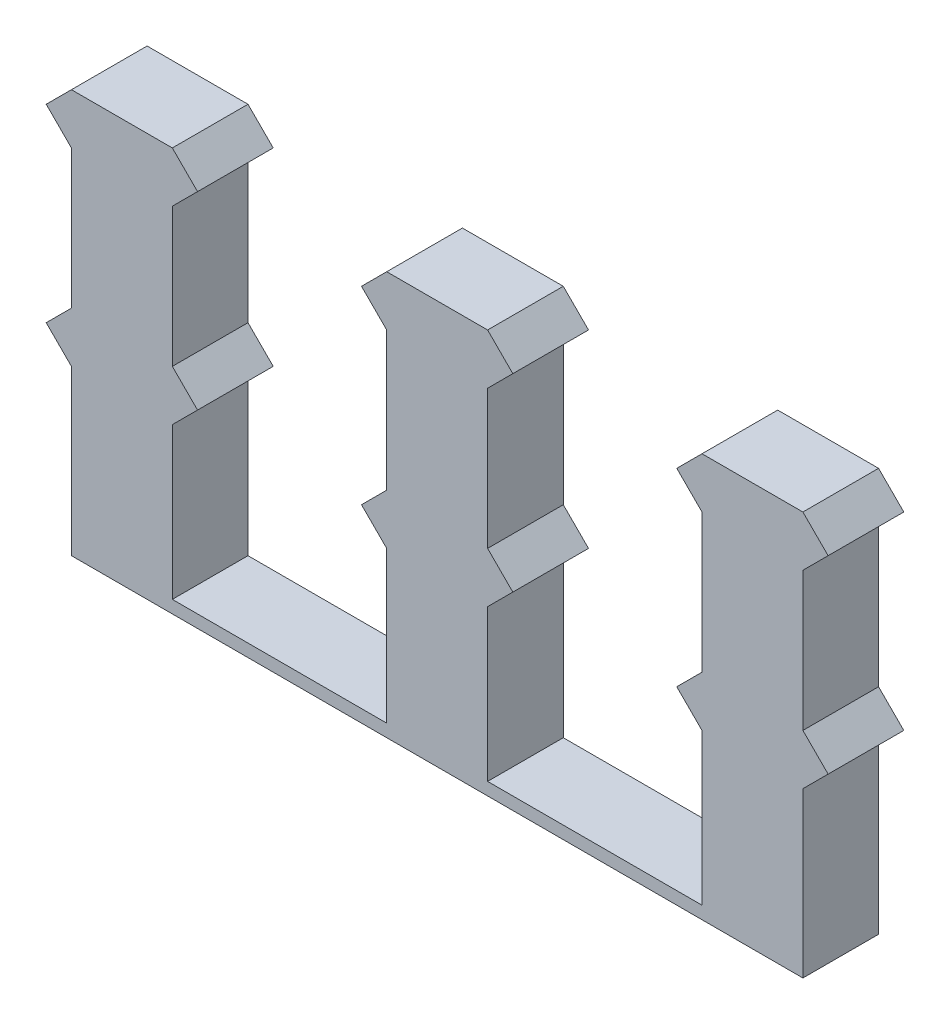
ISO-10303-21;
HEADER;
FILE_DESCRIPTION(('STEP AP214'),'2;1');
FILE_NAME('part.step','',(''),(''),'','','');
FILE_SCHEMA(('AUTOMOTIVE_DESIGN { 1 0 10303 214 1 1 1 1 }'));
ENDSEC;
DATA;
#1=APPLICATION_CONTEXT('core data for automotive mechanical design processes');
#2=APPLICATION_PROTOCOL_DEFINITION('international standard','automotive_design',2000,#1);
#3=PRODUCT_CONTEXT('',#1,'mechanical');
#4=PRODUCT('Part','Part','',(#3));
#5=PRODUCT_RELATED_PRODUCT_CATEGORY('part','',(#4));
#6=PRODUCT_DEFINITION_FORMATION('','',#4);
#7=PRODUCT_DEFINITION_CONTEXT('part definition',#1,'design');
#8=PRODUCT_DEFINITION('design','',#6,#7);
#9=PRODUCT_DEFINITION_SHAPE('','',#8);
#10=(LENGTH_UNIT() NAMED_UNIT(*) SI_UNIT(.MILLI.,.METRE.));
#11=(NAMED_UNIT(*) PLANE_ANGLE_UNIT() SI_UNIT($,.RADIAN.));
#12=(NAMED_UNIT(*) SI_UNIT($,.STERADIAN.) SOLID_ANGLE_UNIT());
#13=UNCERTAINTY_MEASURE_WITH_UNIT(LENGTH_MEASURE(1.E-05),#10,'distance_accuracy_value','');
#14=(GEOMETRIC_REPRESENTATION_CONTEXT(3) GLOBAL_UNCERTAINTY_ASSIGNED_CONTEXT((#13)) GLOBAL_UNIT_ASSIGNED_CONTEXT((#10,
#11,#12)) REPRESENTATION_CONTEXT('',''));
#15=CARTESIAN_POINT('',(0.,0.,0.));
#16=DIRECTION('',(0.,0.,1.));
#17=DIRECTION('',(1.,0.,0.));
#18=AXIS2_PLACEMENT_3D('',#15,#16,#17);
#19=CARTESIAN_POINT('',(0.,0.,0.));
#20=DIRECTION('',(0.,0.,1.));
#21=DIRECTION('',(1.,0.,0.));
#22=AXIS2_PLACEMENT_3D('',#19,#20,#21);
#23=PLANE('',#22);
#24=DIRECTION('',(0.707106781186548,0.707106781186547,0.));
#25=VECTOR('',#24,1.);
#26=CARTESIAN_POINT('',(3.3,1.3,0.));
#27=LINE('',#26,#25);
#28=CARTESIAN_POINT('',(3.3,1.3,0.));
#29=VERTEX_POINT('',#28);
#30=CARTESIAN_POINT('',(3.5,1.5,0.));
#31=VERTEX_POINT('',#30);
#32=EDGE_CURVE('E331',#29,#31,#27,.T.);
#33=ORIENTED_EDGE('',*,*,#32,.F.);
#34=DIRECTION('',(0.,1.,0.));
#35=VECTOR('',#34,1.);
#36=CARTESIAN_POINT('',(3.3,0.,0.));
#37=LINE('',#36,#35);
#38=CARTESIAN_POINT('',(3.3,0.1,0.));
#39=VERTEX_POINT('',#38);
#40=EDGE_CURVE('E329',#39,#29,#37,.T.);
#41=ORIENTED_EDGE('',*,*,#40,.F.);
#42=DIRECTION('',(1.,0.,0.));
#43=VECTOR('',#42,1.);
#44=CARTESIAN_POINT('',(0.,0.1,0.));
#45=LINE('',#44,#43);
#46=CARTESIAN_POINT('',(5.,0.1,0.));
#47=VERTEX_POINT('',#46);
#48=EDGE_CURVE('E327',#47,#39,#45,.F.);
#49=ORIENTED_EDGE('',*,*,#48,.F.);
#50=DIRECTION('',(0.,1.,0.));
#51=VECTOR('',#50,1.);
#52=CARTESIAN_POINT('',(5.,0.,0.));
#53=LINE('',#52,#51);
#54=CARTESIAN_POINT('',(5.,1.3,0.));
#55=VERTEX_POINT('',#54);
#56=EDGE_CURVE('E325',#55,#47,#53,.F.);
#57=ORIENTED_EDGE('',*,*,#56,.F.);
#58=DIRECTION('',(0.707106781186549,-0.707106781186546,0.));
#59=VECTOR('',#58,1.);
#60=CARTESIAN_POINT('',(4.8,1.5,0.));
#61=LINE('',#60,#59);
#62=CARTESIAN_POINT('',(4.8,1.5,0.));
#63=VERTEX_POINT('',#62);
#64=EDGE_CURVE('E323',#63,#55,#61,.T.);
#65=ORIENTED_EDGE('',*,*,#64,.F.);
#66=DIRECTION('',(-0.707106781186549,-0.707106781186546,0.));
#67=VECTOR('',#66,1.);
#68=CARTESIAN_POINT('',(5.,1.7,0.));
#69=LINE('',#68,#67);
#70=CARTESIAN_POINT('',(5.,1.7,0.));
#71=VERTEX_POINT('',#70);
#72=EDGE_CURVE('E321',#71,#63,#69,.T.);
#73=ORIENTED_EDGE('',*,*,#72,.F.);
#74=DIRECTION('',(0.,1.,0.));
#75=VECTOR('',#74,1.);
#76=CARTESIAN_POINT('',(5.,0.,0.));
#77=LINE('',#76,#75);
#78=CARTESIAN_POINT('',(5.,2.8,0.));
#79=VERTEX_POINT('',#78);
#80=EDGE_CURVE('E319',#79,#71,#77,.F.);
#81=ORIENTED_EDGE('',*,*,#80,.F.);
#82=DIRECTION('',(0.707106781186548,-0.707106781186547,0.));
#83=VECTOR('',#82,1.);
#84=CARTESIAN_POINT('',(4.8,3.,0.));
#85=LINE('',#84,#83);
#86=CARTESIAN_POINT('',(4.8,3.,0.));
#87=VERTEX_POINT('',#86);
#88=EDGE_CURVE('E317',#87,#79,#85,.T.);
#89=ORIENTED_EDGE('',*,*,#88,.F.);
#90=DIRECTION('',(-0.707106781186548,-0.707106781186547,0.));
#91=VECTOR('',#90,1.);
#92=CARTESIAN_POINT('',(5.,3.2,0.));
#93=LINE('',#92,#91);
#94=CARTESIAN_POINT('',(5.,3.2,0.));
#95=VERTEX_POINT('',#94);
#96=EDGE_CURVE('E315',#95,#87,#93,.T.);
#97=ORIENTED_EDGE('',*,*,#96,.F.);
#98=DIRECTION('',(1.,0.,0.));
#99=VECTOR('',#98,1.);
#100=CARTESIAN_POINT('',(0.,3.2,0.));
#101=LINE('',#100,#99);
#102=CARTESIAN_POINT('',(5.8,3.2,0.));
#103=VERTEX_POINT('',#102);
#104=EDGE_CURVE('E313',#103,#95,#101,.F.);
#105=ORIENTED_EDGE('',*,*,#104,.F.);
#106=DIRECTION('',(-0.707106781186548,0.707106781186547,0.));
#107=VECTOR('',#106,1.);
#108=CARTESIAN_POINT('',(6.,3.,0.));
#109=LINE('',#108,#107);
#110=CARTESIAN_POINT('',(6.,3.,0.));
#111=VERTEX_POINT('',#110);
#112=EDGE_CURVE('E311',#111,#103,#109,.T.);
#113=ORIENTED_EDGE('',*,*,#112,.F.);
#114=DIRECTION('',(0.707106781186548,0.707106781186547,0.));
#115=VECTOR('',#114,1.);
#116=CARTESIAN_POINT('',(5.8,2.8,0.));
#117=LINE('',#116,#115);
#118=CARTESIAN_POINT('',(5.8,2.8,0.));
#119=VERTEX_POINT('',#118);
#120=EDGE_CURVE('E309',#119,#111,#117,.T.);
#121=ORIENTED_EDGE('',*,*,#120,.F.);
#122=DIRECTION('',(0.,1.,0.));
#123=VECTOR('',#122,1.);
#124=CARTESIAN_POINT('',(5.8,0.,0.));
#125=LINE('',#124,#123);
#126=CARTESIAN_POINT('',(5.8,1.7,0.));
#127=VERTEX_POINT('',#126);
#128=EDGE_CURVE('E305',#127,#119,#125,.T.);
#129=ORIENTED_EDGE('',*,*,#128,.F.);
#130=DIRECTION('',(-0.707106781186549,0.707106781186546,0.));
#131=VECTOR('',#130,1.);
#132=CARTESIAN_POINT('',(6.,1.5,0.));
#133=LINE('',#132,#131);
#134=CARTESIAN_POINT('',(6.,1.5,0.));
#135=VERTEX_POINT('',#134);
#136=EDGE_CURVE('E304',#135,#127,#133,.T.);
#137=ORIENTED_EDGE('',*,*,#136,.F.);
#138=DIRECTION('',(0.707106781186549,0.707106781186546,0.));
#139=VECTOR('',#138,1.);
#140=CARTESIAN_POINT('',(5.8,1.3,0.));
#141=LINE('',#140,#139);
#142=CARTESIAN_POINT('',(5.8,1.3,0.));
#143=VERTEX_POINT('',#142);
#144=EDGE_CURVE('E283',#143,#135,#141,.T.);
#145=ORIENTED_EDGE('',*,*,#144,.F.);
#146=DIRECTION('',(0.,1.,0.));
#147=VECTOR('',#146,1.);
#148=CARTESIAN_POINT('',(5.8,0.,0.));
#149=LINE('',#148,#147);
#150=CARTESIAN_POINT('',(5.8,0.,0.));
#151=VERTEX_POINT('',#150);
#152=EDGE_CURVE('E20',#151,#143,#149,.T.);
#153=ORIENTED_EDGE('',*,*,#152,.F.);
#154=DIRECTION('',(1.,0.,0.));
#155=VECTOR('',#154,1.);
#156=CARTESIAN_POINT('',(0.,0.,0.));
#157=LINE('',#156,#155);
#158=CARTESIAN_POINT('',(0.,0.,0.));
#159=VERTEX_POINT('',#158);
#160=EDGE_CURVE('E480',#159,#151,#157,.T.);
#161=ORIENTED_EDGE('',*,*,#160,.F.);
#162=DIRECTION('',(0.,1.,0.));
#163=VECTOR('',#162,1.);
#164=CARTESIAN_POINT('',(0.,1.3,0.));
#165=LINE('',#164,#163);
#166=CARTESIAN_POINT('',(0.,1.3,0.));
#167=VERTEX_POINT('',#166);
#168=EDGE_CURVE('E474',#167,#159,#165,.F.);
#169=ORIENTED_EDGE('',*,*,#168,.F.);
#170=DIRECTION('',(0.707106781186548,-0.707106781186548,0.));
#171=VECTOR('',#170,1.);
#172=CARTESIAN_POINT('',(-0.2,1.5,0.));
#173=LINE('',#172,#171);
#174=CARTESIAN_POINT('',(-0.2,1.5,0.));
#175=VERTEX_POINT('',#174);
#176=EDGE_CURVE('E468',#175,#167,#173,.T.);
#177=ORIENTED_EDGE('',*,*,#176,.F.);
#178=DIRECTION('',(-0.707106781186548,-0.707106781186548,0.));
#179=VECTOR('',#178,1.);
#180=CARTESIAN_POINT('',(0.,1.7,0.));
#181=LINE('',#180,#179);
#182=CARTESIAN_POINT('',(0.,1.7,0.));
#183=VERTEX_POINT('',#182);
#184=EDGE_CURVE('E462',#183,#175,#181,.T.);
#185=ORIENTED_EDGE('',*,*,#184,.F.);
#186=DIRECTION('',(0.,1.,0.));
#187=VECTOR('',#186,1.);
#188=CARTESIAN_POINT('',(0.,2.8,0.));
#189=LINE('',#188,#187);
#190=CARTESIAN_POINT('',(0.,2.8,0.));
#191=VERTEX_POINT('',#190);
#192=EDGE_CURVE('E456',#191,#183,#189,.F.);
#193=ORIENTED_EDGE('',*,*,#192,.F.);
#194=DIRECTION('',(0.707106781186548,-0.707106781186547,0.));
#195=VECTOR('',#194,1.);
#196=CARTESIAN_POINT('',(-0.2,3.,0.));
#197=LINE('',#196,#195);
#198=CARTESIAN_POINT('',(-0.200000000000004,3.,0.));
#199=VERTEX_POINT('',#198);
#200=EDGE_CURVE('E450',#199,#191,#197,.T.);
#201=ORIENTED_EDGE('',*,*,#200,.F.);
#202=DIRECTION('',(-0.707106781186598,-0.707106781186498,0.));
#203=VECTOR('',#202,1.);
#204=CARTESIAN_POINT('',(0.,3.2,0.));
#205=LINE('',#204,#203);
#206=CARTESIAN_POINT('',(0.,3.2,0.));
#207=VERTEX_POINT('',#206);
#208=EDGE_CURVE('E444',#207,#199,#205,.T.);
#209=ORIENTED_EDGE('',*,*,#208,.F.);
#210=DIRECTION('',(1.,0.,0.));
#211=VECTOR('',#210,1.);
#212=CARTESIAN_POINT('',(0.8,3.2,0.));
#213=LINE('',#212,#211);
#214=CARTESIAN_POINT('',(0.799999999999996,3.2,0.));
#215=VERTEX_POINT('',#214);
#216=EDGE_CURVE('E438',#215,#207,#213,.F.);
#217=ORIENTED_EDGE('',*,*,#216,.F.);
#218=DIRECTION('',(-0.707106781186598,0.707106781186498,0.));
#219=VECTOR('',#218,1.);
#220=CARTESIAN_POINT('',(1.,3.,0.));
#221=LINE('',#220,#219);
#222=CARTESIAN_POINT('',(1.,3.,0.));
#223=VERTEX_POINT('',#222);
#224=EDGE_CURVE('E432',#223,#215,#221,.T.);
#225=ORIENTED_EDGE('',*,*,#224,.F.);
#226=DIRECTION('',(0.707106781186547,0.707106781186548,0.));
#227=VECTOR('',#226,1.);
#228=CARTESIAN_POINT('',(0.8,2.8,0.));
#229=LINE('',#228,#227);
#230=CARTESIAN_POINT('',(0.8,2.8,0.));
#231=VERTEX_POINT('',#230);
#232=EDGE_CURVE('E426',#231,#223,#229,.T.);
#233=ORIENTED_EDGE('',*,*,#232,.F.);
#234=DIRECTION('',(0.,1.,0.));
#235=VECTOR('',#234,1.);
#236=CARTESIAN_POINT('',(0.8,1.7,0.));
#237=LINE('',#236,#235);
#238=CARTESIAN_POINT('',(0.8,1.7,0.));
#239=VERTEX_POINT('',#238);
#240=EDGE_CURVE('E420',#239,#231,#237,.T.);
#241=ORIENTED_EDGE('',*,*,#240,.F.);
#242=DIRECTION('',(-0.707106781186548,0.707106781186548,0.));
#243=VECTOR('',#242,1.);
#244=CARTESIAN_POINT('',(1.,1.5,0.));
#245=LINE('',#244,#243);
#246=CARTESIAN_POINT('',(1.,1.5,0.));
#247=VERTEX_POINT('',#246);
#248=EDGE_CURVE('E414',#247,#239,#245,.T.);
#249=ORIENTED_EDGE('',*,*,#248,.F.);
#250=DIRECTION('',(0.707106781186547,0.707106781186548,0.));
#251=VECTOR('',#250,1.);
#252=CARTESIAN_POINT('',(0.8,1.3,0.));
#253=LINE('',#252,#251);
#254=CARTESIAN_POINT('',(0.8,1.3,0.));
#255=VERTEX_POINT('',#254);
#256=EDGE_CURVE('E408',#255,#247,#253,.T.);
#257=ORIENTED_EDGE('',*,*,#256,.F.);
#258=DIRECTION('',(0.,1.,0.));
#259=VECTOR('',#258,1.);
#260=CARTESIAN_POINT('',(0.8,0.1,0.));
#261=LINE('',#260,#259);
#262=CARTESIAN_POINT('',(0.8,0.1,0.));
#263=VERTEX_POINT('',#262);
#264=EDGE_CURVE('E402',#263,#255,#261,.T.);
#265=ORIENTED_EDGE('',*,*,#264,.F.);
#266=DIRECTION('',(1.,0.,0.));
#267=VECTOR('',#266,1.);
#268=CARTESIAN_POINT('',(2.5,0.1,0.));
#269=LINE('',#268,#267);
#270=CARTESIAN_POINT('',(2.5,0.1,0.));
#271=VERTEX_POINT('',#270);
#272=EDGE_CURVE('E396',#271,#263,#269,.F.);
#273=ORIENTED_EDGE('',*,*,#272,.F.);
#274=DIRECTION('',(0.,1.,0.));
#275=VECTOR('',#274,1.);
#276=CARTESIAN_POINT('',(2.5,1.3,0.));
#277=LINE('',#276,#275);
#278=CARTESIAN_POINT('',(2.5,1.3,0.));
#279=VERTEX_POINT('',#278);
#280=EDGE_CURVE('E390',#279,#271,#277,.F.);
#281=ORIENTED_EDGE('',*,*,#280,.F.);
#282=DIRECTION('',(0.707106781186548,-0.707106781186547,0.));
#283=VECTOR('',#282,1.);
#284=CARTESIAN_POINT('',(2.3,1.5,0.));
#285=LINE('',#284,#283);
#286=CARTESIAN_POINT('',(2.3,1.5,0.));
#287=VERTEX_POINT('',#286);
#288=EDGE_CURVE('E384',#287,#279,#285,.T.);
#289=ORIENTED_EDGE('',*,*,#288,.F.);
#290=DIRECTION('',(-0.707106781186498,-0.707106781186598,0.));
#291=VECTOR('',#290,1.);
#292=CARTESIAN_POINT('',(2.5,1.7,0.));
#293=LINE('',#292,#291);
#294=CARTESIAN_POINT('',(2.5,1.7,0.));
#295=VERTEX_POINT('',#294);
#296=EDGE_CURVE('E378',#295,#287,#293,.T.);
#297=ORIENTED_EDGE('',*,*,#296,.F.);
#298=DIRECTION('',(0.,1.,0.));
#299=VECTOR('',#298,1.);
#300=CARTESIAN_POINT('',(2.5,2.8,0.));
#301=LINE('',#300,#299);
#302=CARTESIAN_POINT('',(2.5,2.8,0.));
#303=VERTEX_POINT('',#302);
#304=EDGE_CURVE('E372',#303,#295,#301,.F.);
#305=ORIENTED_EDGE('',*,*,#304,.F.);
#306=DIRECTION('',(0.707106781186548,-0.707106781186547,0.));
#307=VECTOR('',#306,1.);
#308=CARTESIAN_POINT('',(2.3,3.,0.));
#309=LINE('',#308,#307);
#310=CARTESIAN_POINT('',(2.3,3.,0.));
#311=VERTEX_POINT('',#310);
#312=EDGE_CURVE('E366',#311,#303,#309,.T.);
#313=ORIENTED_EDGE('',*,*,#312,.F.);
#314=DIRECTION('',(-0.707106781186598,-0.707106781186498,0.));
#315=VECTOR('',#314,1.);
#316=CARTESIAN_POINT('',(2.5,3.2,0.));
#317=LINE('',#316,#315);
#318=CARTESIAN_POINT('',(2.5,3.2,0.));
#319=VERTEX_POINT('',#318);
#320=EDGE_CURVE('E360',#319,#311,#317,.T.);
#321=ORIENTED_EDGE('',*,*,#320,.F.);
#322=DIRECTION('',(1.,0.,0.));
#323=VECTOR('',#322,1.);
#324=CARTESIAN_POINT('',(3.3,3.2,0.));
#325=LINE('',#324,#323);
#326=CARTESIAN_POINT('',(3.3,3.2,0.));
#327=VERTEX_POINT('',#326);
#328=EDGE_CURVE('E354',#327,#319,#325,.F.);
#329=ORIENTED_EDGE('',*,*,#328,.F.);
#330=DIRECTION('',(-0.707106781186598,0.707106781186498,0.));
#331=VECTOR('',#330,1.);
#332=CARTESIAN_POINT('',(3.5,3.,0.));
#333=LINE('',#332,#331);
#334=CARTESIAN_POINT('',(3.5,3.,0.));
#335=VERTEX_POINT('',#334);
#336=EDGE_CURVE('E348',#335,#327,#333,.T.);
#337=ORIENTED_EDGE('',*,*,#336,.F.);
#338=DIRECTION('',(0.707106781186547,0.707106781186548,0.));
#339=VECTOR('',#338,1.);
#340=CARTESIAN_POINT('',(3.3,2.8,0.));
#341=LINE('',#340,#339);
#342=CARTESIAN_POINT('',(3.3,2.8,0.));
#343=VERTEX_POINT('',#342);
#344=EDGE_CURVE('E342',#343,#335,#341,.T.);
#345=ORIENTED_EDGE('',*,*,#344,.F.);
#346=DIRECTION('',(0.,1.,0.));
#347=VECTOR('',#346,1.);
#348=CARTESIAN_POINT('',(3.3,1.7,0.));
#349=LINE('',#348,#347);
#350=CARTESIAN_POINT('',(3.3,1.7,0.));
#351=VERTEX_POINT('',#350);
#352=EDGE_CURVE('E336',#351,#343,#349,.T.);
#353=ORIENTED_EDGE('',*,*,#352,.F.);
#354=DIRECTION('',(-0.707106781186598,0.707106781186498,0.));
#355=VECTOR('',#354,1.);
#356=CARTESIAN_POINT('',(3.5,1.5,0.));
#357=LINE('',#356,#355);
#358=EDGE_CURVE('E333',#31,#351,#357,.T.);
#359=ORIENTED_EDGE('',*,*,#358,.F.);
#360=EDGE_LOOP('',(#33,#41,#49,#57,#65,#73,#81,#89,#97,#105,#113,#121,#129,#137,#145,#153,#161,
#169,#177,#185,#193,#201,#209,#217,#225,#233,#241,#249,#257,#265,#273,#281,#289,#297,#305,#313,
#321,#329,#337,#345,#353,#359));
#361=FACE_BOUND('',#360,.T.);
#362=ADVANCED_FACE('F17',(#361),#23,.F.);
#363=CARTESIAN_POINT('',(3.5,1.5,0.));
#364=DIRECTION('',(0.707106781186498,0.707106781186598,0.));
#365=DIRECTION('',(-0.707106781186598,0.707106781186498,0.));
#366=AXIS2_PLACEMENT_3D('',#363,#364,#365);
#367=PLANE('',#366);
#368=DIRECTION('',(-0.707106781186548,0.707106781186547,0.));
#369=VECTOR('',#368,1.);
#370=CARTESIAN_POINT('',(3.5,1.5,0.6));
#371=LINE('',#370,#369);
#372=CARTESIAN_POINT('',(3.5,1.5,0.6));
#373=VERTEX_POINT('',#372);
#374=CARTESIAN_POINT('',(3.29999999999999,1.69999999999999,0.6));
#375=VERTEX_POINT('',#374);
#376=EDGE_CURVE('E527',#373,#375,#371,.T.);
#377=ORIENTED_EDGE('',*,*,#376,.F.);
#378=DIRECTION('',(0.,0.,1.));
#379=VECTOR('',#378,1.);
#380=CARTESIAN_POINT('',(3.5,1.5,0.));
#381=LINE('',#380,#379);
#382=EDGE_CURVE('E523',#31,#373,#381,.T.);
#383=ORIENTED_EDGE('',*,*,#382,.F.);
#384=ORIENTED_EDGE('',*,*,#358,.T.);
#385=DIRECTION('',(0.,0.,-1.));
#386=VECTOR('',#385,1.);
#387=CARTESIAN_POINT('',(3.3,1.7,0.));
#388=LINE('',#387,#386);
#389=EDGE_CURVE('E339',#375,#351,#388,.T.);
#390=ORIENTED_EDGE('',*,*,#389,.F.);
#391=EDGE_LOOP('',(#377,#383,#384,#390));
#392=FACE_BOUND('',#391,.T.);
#393=ADVANCED_FACE('F658',(#392),#367,.T.);
#394=CARTESIAN_POINT('',(3.3,1.7,0.));
#395=DIRECTION('',(1.,0.,0.));
#396=DIRECTION('',(0.,0.,-1.));
#397=AXIS2_PLACEMENT_3D('',#394,#395,#396);
#398=PLANE('',#397);
#399=DIRECTION('',(0.,1.,0.));
#400=VECTOR('',#399,1.);
#401=CARTESIAN_POINT('',(3.3,0.,0.6));
#402=LINE('',#401,#400);
#403=CARTESIAN_POINT('',(3.3,2.8,0.6));
#404=VERTEX_POINT('',#403);
#405=EDGE_CURVE('E530',#375,#404,#402,.T.);
#406=ORIENTED_EDGE('',*,*,#405,.F.);
#407=ORIENTED_EDGE('',*,*,#389,.T.);
#408=ORIENTED_EDGE('',*,*,#352,.T.);
#409=DIRECTION('',(0.,0.,1.));
#410=VECTOR('',#409,1.);
#411=CARTESIAN_POINT('',(3.3,2.8,0.));
#412=LINE('',#411,#410);
#413=EDGE_CURVE('E345',#404,#343,#412,.F.);
#414=ORIENTED_EDGE('',*,*,#413,.F.);
#415=EDGE_LOOP('',(#406,#407,#408,#414));
#416=FACE_BOUND('',#415,.T.);
#417=ADVANCED_FACE('F662',(#416),#398,.T.);
#418=CARTESIAN_POINT('',(3.3,2.8,0.));
#419=DIRECTION('',(0.707106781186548,-0.707106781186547,0.));
#420=DIRECTION('',(0.707106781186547,0.707106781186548,0.));
#421=AXIS2_PLACEMENT_3D('',#418,#419,#420);
#422=PLANE('',#421);
#423=DIRECTION('',(0.707106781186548,0.707106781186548,0.));
#424=VECTOR('',#423,1.);
#425=CARTESIAN_POINT('',(3.3,2.8,0.6));
#426=LINE('',#425,#424);
#427=CARTESIAN_POINT('',(3.5,3.,0.6));
#428=VERTEX_POINT('',#427);
#429=EDGE_CURVE('E533',#404,#428,#426,.T.);
#430=ORIENTED_EDGE('',*,*,#429,.F.);
#431=ORIENTED_EDGE('',*,*,#413,.T.);
#432=ORIENTED_EDGE('',*,*,#344,.T.);
#433=DIRECTION('',(0.,0.,1.));
#434=VECTOR('',#433,1.);
#435=CARTESIAN_POINT('',(3.5,3.,0.));
#436=LINE('',#435,#434);
#437=EDGE_CURVE('E351',#428,#335,#436,.F.);
#438=ORIENTED_EDGE('',*,*,#437,.F.);
#439=EDGE_LOOP('',(#430,#431,#432,#438));
#440=FACE_BOUND('',#439,.T.);
#441=ADVANCED_FACE('F664',(#440),#422,.T.);
#442=CARTESIAN_POINT('',(3.5,3.,0.));
#443=DIRECTION('',(0.707106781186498,0.707106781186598,0.));
#444=DIRECTION('',(-0.707106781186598,0.707106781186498,0.));
#445=AXIS2_PLACEMENT_3D('',#442,#443,#444);
#446=PLANE('',#445);
#447=DIRECTION('',(-0.707106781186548,0.707106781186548,0.));
#448=VECTOR('',#447,1.);
#449=CARTESIAN_POINT('',(3.5,3.,0.6));
#450=LINE('',#449,#448);
#451=CARTESIAN_POINT('',(3.29999999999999,3.19999999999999,0.6));
#452=VERTEX_POINT('',#451);
#453=EDGE_CURVE('E536',#428,#452,#450,.T.);
#454=ORIENTED_EDGE('',*,*,#453,.F.);
#455=ORIENTED_EDGE('',*,*,#437,.T.);
#456=ORIENTED_EDGE('',*,*,#336,.T.);
#457=DIRECTION('',(0.,0.,1.));
#458=VECTOR('',#457,1.);
#459=CARTESIAN_POINT('',(3.3,3.2,0.));
#460=LINE('',#459,#458);
#461=EDGE_CURVE('E357',#452,#327,#460,.F.);
#462=ORIENTED_EDGE('',*,*,#461,.F.);
#463=EDGE_LOOP('',(#454,#455,#456,#462));
#464=FACE_BOUND('',#463,.T.);
#465=ADVANCED_FACE('F667',(#464),#446,.T.);
#466=CARTESIAN_POINT('',(3.3,3.2,0.));
#467=DIRECTION('',(0.,1.,0.));
#468=DIRECTION('',(0.,0.,1.));
#469=AXIS2_PLACEMENT_3D('',#466,#467,#468);
#470=PLANE('',#469);
#471=DIRECTION('',(1.,0.,0.));
#472=VECTOR('',#471,1.);
#473=CARTESIAN_POINT('',(0.,3.2,0.6));
#474=LINE('',#473,#472);
#475=CARTESIAN_POINT('',(2.5,3.2,0.6));
#476=VERTEX_POINT('',#475);
#477=EDGE_CURVE('E539',#452,#476,#474,.F.);
#478=ORIENTED_EDGE('',*,*,#477,.F.);
#479=ORIENTED_EDGE('',*,*,#461,.T.);
#480=ORIENTED_EDGE('',*,*,#328,.T.);
#481=DIRECTION('',(0.,0.,1.));
#482=VECTOR('',#481,1.);
#483=CARTESIAN_POINT('',(2.5,3.2,0.));
#484=LINE('',#483,#482);
#485=EDGE_CURVE('E363',#476,#319,#484,.F.);
#486=ORIENTED_EDGE('',*,*,#485,.F.);
#487=EDGE_LOOP('',(#478,#479,#480,#486));
#488=FACE_BOUND('',#487,.T.);
#489=ADVANCED_FACE('F671',(#488),#470,.T.);
#490=CARTESIAN_POINT('',(2.5,3.2,0.));
#491=DIRECTION('',(-0.707106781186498,0.707106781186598,0.));
#492=DIRECTION('',(-0.707106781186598,-0.707106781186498,0.));
#493=AXIS2_PLACEMENT_3D('',#490,#491,#492);
#494=PLANE('',#493);
#495=DIRECTION('',(-0.707106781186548,-0.707106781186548,0.));
#496=VECTOR('',#495,1.);
#497=CARTESIAN_POINT('',(2.5,3.2,0.6));
#498=LINE('',#497,#496);
#499=CARTESIAN_POINT('',(2.29999999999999,3.00000000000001,0.6));
#500=VERTEX_POINT('',#499);
#501=EDGE_CURVE('E542',#476,#500,#498,.T.);
#502=ORIENTED_EDGE('',*,*,#501,.F.);
#503=ORIENTED_EDGE('',*,*,#485,.T.);
#504=ORIENTED_EDGE('',*,*,#320,.T.);
#505=DIRECTION('',(0.,0.,1.));
#506=VECTOR('',#505,1.);
#507=CARTESIAN_POINT('',(2.3,3.,0.));
#508=LINE('',#507,#506);
#509=EDGE_CURVE('E369',#500,#311,#508,.F.);
#510=ORIENTED_EDGE('',*,*,#509,.F.);
#511=EDGE_LOOP('',(#502,#503,#504,#510));
#512=FACE_BOUND('',#511,.T.);
#513=ADVANCED_FACE('F673',(#512),#494,.T.);
#514=CARTESIAN_POINT('',(2.3,3.,0.));
#515=DIRECTION('',(-0.707106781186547,-0.707106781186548,0.));
#516=DIRECTION('',(0.707106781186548,-0.707106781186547,0.));
#517=AXIS2_PLACEMENT_3D('',#514,#515,#516);
#518=PLANE('',#517);
#519=DIRECTION('',(0.707106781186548,-0.707106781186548,0.));
#520=VECTOR('',#519,1.);
#521=CARTESIAN_POINT('',(2.3,3.,0.6));
#522=LINE('',#521,#520);
#523=CARTESIAN_POINT('',(2.5,2.8,0.6));
#524=VERTEX_POINT('',#523);
#525=EDGE_CURVE('E545',#500,#524,#522,.T.);
#526=ORIENTED_EDGE('',*,*,#525,.F.);
#527=ORIENTED_EDGE('',*,*,#509,.T.);
#528=ORIENTED_EDGE('',*,*,#312,.T.);
#529=DIRECTION('',(0.,0.,1.));
#530=VECTOR('',#529,1.);
#531=CARTESIAN_POINT('',(2.5,2.8,0.));
#532=LINE('',#531,#530);
#533=EDGE_CURVE('E375',#524,#303,#532,.F.);
#534=ORIENTED_EDGE('',*,*,#533,.F.);
#535=EDGE_LOOP('',(#526,#527,#528,#534));
#536=FACE_BOUND('',#535,.T.);
#537=ADVANCED_FACE('F676',(#536),#518,.T.);
#538=CARTESIAN_POINT('',(2.5,2.8,0.));
#539=DIRECTION('',(-1.,0.,0.));
#540=DIRECTION('',(0.,0.,1.));
#541=AXIS2_PLACEMENT_3D('',#538,#539,#540);
#542=PLANE('',#541);
#543=DIRECTION('',(0.,1.,0.));
#544=VECTOR('',#543,1.);
#545=CARTESIAN_POINT('',(2.5,0.,0.6));
#546=LINE('',#545,#544);
#547=CARTESIAN_POINT('',(2.5,1.7,0.6));
#548=VERTEX_POINT('',#547);
#549=EDGE_CURVE('E548',#524,#548,#546,.F.);
#550=ORIENTED_EDGE('',*,*,#549,.F.);
#551=ORIENTED_EDGE('',*,*,#533,.T.);
#552=ORIENTED_EDGE('',*,*,#304,.T.);
#553=DIRECTION('',(0.,0.,1.));
#554=VECTOR('',#553,1.);
#555=CARTESIAN_POINT('',(2.5,1.7,0.));
#556=LINE('',#555,#554);
#557=EDGE_CURVE('E381',#548,#295,#556,.F.);
#558=ORIENTED_EDGE('',*,*,#557,.F.);
#559=EDGE_LOOP('',(#550,#551,#552,#558));
#560=FACE_BOUND('',#559,.T.);
#561=ADVANCED_FACE('F680',(#560),#542,.T.);
#562=CARTESIAN_POINT('',(2.5,1.7,0.));
#563=DIRECTION('',(-0.707106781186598,0.707106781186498,0.));
#564=DIRECTION('',(-0.707106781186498,-0.707106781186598,0.));
#565=AXIS2_PLACEMENT_3D('',#562,#563,#564);
#566=PLANE('',#565);
#567=DIRECTION('',(-0.707106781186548,-0.707106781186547,0.));
#568=VECTOR('',#567,1.);
#569=CARTESIAN_POINT('',(2.5,1.7,0.6));
#570=LINE('',#569,#568);
#571=CARTESIAN_POINT('',(2.30000000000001,1.49999999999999,0.6));
#572=VERTEX_POINT('',#571);
#573=EDGE_CURVE('E551',#548,#572,#570,.T.);
#574=ORIENTED_EDGE('',*,*,#573,.F.);
#575=ORIENTED_EDGE('',*,*,#557,.T.);
#576=ORIENTED_EDGE('',*,*,#296,.T.);
#577=DIRECTION('',(0.,0.,1.));
#578=VECTOR('',#577,1.);
#579=CARTESIAN_POINT('',(2.3,1.5,0.));
#580=LINE('',#579,#578);
#581=EDGE_CURVE('E387',#572,#287,#580,.F.);
#582=ORIENTED_EDGE('',*,*,#581,.F.);
#583=EDGE_LOOP('',(#574,#575,#576,#582));
#584=FACE_BOUND('',#583,.T.);
#585=ADVANCED_FACE('F682',(#584),#566,.T.);
#586=CARTESIAN_POINT('',(2.3,1.5,0.));
#587=DIRECTION('',(-0.707106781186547,-0.707106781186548,0.));
#588=DIRECTION('',(0.707106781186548,-0.707106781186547,0.));
#589=AXIS2_PLACEMENT_3D('',#586,#587,#588);
#590=PLANE('',#589);
#591=DIRECTION('',(0.707106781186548,-0.707106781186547,0.));
#592=VECTOR('',#591,1.);
#593=CARTESIAN_POINT('',(2.3,1.5,0.6));
#594=LINE('',#593,#592);
#595=CARTESIAN_POINT('',(2.5,1.3,0.6));
#596=VERTEX_POINT('',#595);
#597=EDGE_CURVE('E554',#572,#596,#594,.T.);
#598=ORIENTED_EDGE('',*,*,#597,.F.);
#599=ORIENTED_EDGE('',*,*,#581,.T.);
#600=ORIENTED_EDGE('',*,*,#288,.T.);
#601=DIRECTION('',(0.,0.,1.));
#602=VECTOR('',#601,1.);
#603=CARTESIAN_POINT('',(2.5,1.3,0.));
#604=LINE('',#603,#602);
#605=EDGE_CURVE('E393',#596,#279,#604,.F.);
#606=ORIENTED_EDGE('',*,*,#605,.F.);
#607=EDGE_LOOP('',(#598,#599,#600,#606));
#608=FACE_BOUND('',#607,.T.);
#609=ADVANCED_FACE('F685',(#608),#590,.T.);
#610=CARTESIAN_POINT('',(2.5,1.3,0.));
#611=DIRECTION('',(-1.,0.,0.));
#612=DIRECTION('',(0.,0.,1.));
#613=AXIS2_PLACEMENT_3D('',#610,#611,#612);
#614=PLANE('',#613);
#615=DIRECTION('',(0.,1.,0.));
#616=VECTOR('',#615,1.);
#617=CARTESIAN_POINT('',(2.5,0.,0.6));
#618=LINE('',#617,#616);
#619=CARTESIAN_POINT('',(2.5,0.1,0.6));
#620=VERTEX_POINT('',#619);
#621=EDGE_CURVE('E557',#596,#620,#618,.F.);
#622=ORIENTED_EDGE('',*,*,#621,.F.);
#623=ORIENTED_EDGE('',*,*,#605,.T.);
#624=ORIENTED_EDGE('',*,*,#280,.T.);
#625=DIRECTION('',(0.,0.,1.));
#626=VECTOR('',#625,1.);
#627=CARTESIAN_POINT('',(2.5,0.1,0.));
#628=LINE('',#627,#626);
#629=EDGE_CURVE('E399',#620,#271,#628,.F.);
#630=ORIENTED_EDGE('',*,*,#629,.F.);
#631=EDGE_LOOP('',(#622,#623,#624,#630));
#632=FACE_BOUND('',#631,.T.);
#633=ADVANCED_FACE('F689',(#632),#614,.T.);
#634=CARTESIAN_POINT('',(2.5,0.1,0.));
#635=DIRECTION('',(0.,1.,0.));
#636=DIRECTION('',(0.,0.,1.));
#637=AXIS2_PLACEMENT_3D('',#634,#635,#636);
#638=PLANE('',#637);
#639=DIRECTION('',(1.,0.,0.));
#640=VECTOR('',#639,1.);
#641=CARTESIAN_POINT('',(0.,0.1,0.6));
#642=LINE('',#641,#640);
#643=CARTESIAN_POINT('',(0.8,0.1,0.6));
#644=VERTEX_POINT('',#643);
#645=EDGE_CURVE('E560',#620,#644,#642,.F.);
#646=ORIENTED_EDGE('',*,*,#645,.F.);
#647=ORIENTED_EDGE('',*,*,#629,.T.);
#648=ORIENTED_EDGE('',*,*,#272,.T.);
#649=DIRECTION('',(0.,0.,-1.));
#650=VECTOR('',#649,1.);
#651=CARTESIAN_POINT('',(0.8,0.1,0.));
#652=LINE('',#651,#650);
#653=EDGE_CURVE('E405',#644,#263,#652,.T.);
#654=ORIENTED_EDGE('',*,*,#653,.F.);
#655=EDGE_LOOP('',(#646,#647,#648,#654));
#656=FACE_BOUND('',#655,.T.);
#657=ADVANCED_FACE('F691',(#656),#638,.T.);
#658=CARTESIAN_POINT('',(0.8,0.1,0.));
#659=DIRECTION('',(1.,0.,0.));
#660=DIRECTION('',(0.,0.,-1.));
#661=AXIS2_PLACEMENT_3D('',#658,#659,#660);
#662=PLANE('',#661);
#663=DIRECTION('',(0.,1.,0.));
#664=VECTOR('',#663,1.);
#665=CARTESIAN_POINT('',(0.8,0.,0.6));
#666=LINE('',#665,#664);
#667=CARTESIAN_POINT('',(0.8,1.3,0.6));
#668=VERTEX_POINT('',#667);
#669=EDGE_CURVE('E563',#644,#668,#666,.T.);
#670=ORIENTED_EDGE('',*,*,#669,.F.);
#671=ORIENTED_EDGE('',*,*,#653,.T.);
#672=ORIENTED_EDGE('',*,*,#264,.T.);
#673=DIRECTION('',(0.,0.,1.));
#674=VECTOR('',#673,1.);
#675=CARTESIAN_POINT('',(0.8,1.3,0.));
#676=LINE('',#675,#674);
#677=EDGE_CURVE('E411',#668,#255,#676,.F.);
#678=ORIENTED_EDGE('',*,*,#677,.F.);
#679=EDGE_LOOP('',(#670,#671,#672,#678));
#680=FACE_BOUND('',#679,.T.);
#681=ADVANCED_FACE('F694',(#680),#662,.T.);
#682=CARTESIAN_POINT('',(0.8,1.3,0.));
#683=DIRECTION('',(0.707106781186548,-0.707106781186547,0.));
#684=DIRECTION('',(0.707106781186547,0.707106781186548,0.));
#685=AXIS2_PLACEMENT_3D('',#682,#683,#684);
#686=PLANE('',#685);
#687=DIRECTION('',(0.707106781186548,0.707106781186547,0.));
#688=VECTOR('',#687,1.);
#689=CARTESIAN_POINT('',(0.8,1.3,0.6));
#690=LINE('',#689,#688);
#691=CARTESIAN_POINT('',(1.,1.5,0.6));
#692=VERTEX_POINT('',#691);
#693=EDGE_CURVE('E566',#668,#692,#690,.T.);
#694=ORIENTED_EDGE('',*,*,#693,.F.);
#695=ORIENTED_EDGE('',*,*,#677,.T.);
#696=ORIENTED_EDGE('',*,*,#256,.T.);
#697=DIRECTION('',(0.,0.,1.));
#698=VECTOR('',#697,1.);
#699=CARTESIAN_POINT('',(1.,1.5,0.));
#700=LINE('',#699,#698);
#701=EDGE_CURVE('E417',#692,#247,#700,.F.);
#702=ORIENTED_EDGE('',*,*,#701,.F.);
#703=EDGE_LOOP('',(#694,#695,#696,#702));
#704=FACE_BOUND('',#703,.T.);
#705=ADVANCED_FACE('F698',(#704),#686,.T.);
#706=CARTESIAN_POINT('',(1.,1.5,0.));
#707=DIRECTION('',(0.707106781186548,0.707106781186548,0.));
#708=DIRECTION('',(-0.707106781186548,0.707106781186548,0.));
#709=AXIS2_PLACEMENT_3D('',#706,#707,#708);
#710=PLANE('',#709);
#711=DIRECTION('',(-0.707106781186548,0.707106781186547,0.));
#712=VECTOR('',#711,1.);
#713=CARTESIAN_POINT('',(1.,1.5,0.6));
#714=LINE('',#713,#712);
#715=CARTESIAN_POINT('',(0.8,1.7,0.6));
#716=VERTEX_POINT('',#715);
#717=EDGE_CURVE('E569',#692,#716,#714,.T.);
#718=ORIENTED_EDGE('',*,*,#717,.F.);
#719=ORIENTED_EDGE('',*,*,#701,.T.);
#720=ORIENTED_EDGE('',*,*,#248,.T.);
#721=DIRECTION('',(0.,0.,-1.));
#722=VECTOR('',#721,1.);
#723=CARTESIAN_POINT('',(0.8,1.7,0.));
#724=LINE('',#723,#722);
#725=EDGE_CURVE('E423',#716,#239,#724,.T.);
#726=ORIENTED_EDGE('',*,*,#725,.F.);
#727=EDGE_LOOP('',(#718,#719,#720,#726));
#728=FACE_BOUND('',#727,.T.);
#729=ADVANCED_FACE('F700',(#728),#710,.T.);
#730=CARTESIAN_POINT('',(0.8,1.7,0.));
#731=DIRECTION('',(1.,0.,0.));
#732=DIRECTION('',(0.,0.,-1.));
#733=AXIS2_PLACEMENT_3D('',#730,#731,#732);
#734=PLANE('',#733);
#735=DIRECTION('',(0.,1.,0.));
#736=VECTOR('',#735,1.);
#737=CARTESIAN_POINT('',(0.8,0.,0.6));
#738=LINE('',#737,#736);
#739=CARTESIAN_POINT('',(0.8,2.8,0.6));
#740=VERTEX_POINT('',#739);
#741=EDGE_CURVE('E572',#716,#740,#738,.T.);
#742=ORIENTED_EDGE('',*,*,#741,.F.);
#743=ORIENTED_EDGE('',*,*,#725,.T.);
#744=ORIENTED_EDGE('',*,*,#240,.T.);
#745=DIRECTION('',(0.,0.,1.));
#746=VECTOR('',#745,1.);
#747=CARTESIAN_POINT('',(0.8,2.8,0.));
#748=LINE('',#747,#746);
#749=EDGE_CURVE('E429',#740,#231,#748,.F.);
#750=ORIENTED_EDGE('',*,*,#749,.F.);
#751=EDGE_LOOP('',(#742,#743,#744,#750));
#752=FACE_BOUND('',#751,.T.);
#753=ADVANCED_FACE('F703',(#752),#734,.T.);
#754=CARTESIAN_POINT('',(0.8,2.8,0.));
#755=DIRECTION('',(0.707106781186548,-0.707106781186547,0.));
#756=DIRECTION('',(0.707106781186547,0.707106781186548,0.));
#757=AXIS2_PLACEMENT_3D('',#754,#755,#756);
#758=PLANE('',#757);
#759=DIRECTION('',(0.707106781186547,0.707106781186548,0.));
#760=VECTOR('',#759,1.);
#761=CARTESIAN_POINT('',(0.8,2.8,0.6));
#762=LINE('',#761,#760);
#763=CARTESIAN_POINT('',(1.,3.,0.6));
#764=VERTEX_POINT('',#763);
#765=EDGE_CURVE('E575',#740,#764,#762,.T.);
#766=ORIENTED_EDGE('',*,*,#765,.F.);
#767=ORIENTED_EDGE('',*,*,#749,.T.);
#768=ORIENTED_EDGE('',*,*,#232,.T.);
#769=DIRECTION('',(0.,0.,1.));
#770=VECTOR('',#769,1.);
#771=CARTESIAN_POINT('',(1.,3.,0.));
#772=LINE('',#771,#770);
#773=EDGE_CURVE('E435',#764,#223,#772,.F.);
#774=ORIENTED_EDGE('',*,*,#773,.F.);
#775=EDGE_LOOP('',(#766,#767,#768,#774));
#776=FACE_BOUND('',#775,.T.);
#777=ADVANCED_FACE('F707',(#776),#758,.T.);
#778=CARTESIAN_POINT('',(1.,3.,0.));
#779=DIRECTION('',(0.707106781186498,0.707106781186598,0.));
#780=DIRECTION('',(-0.707106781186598,0.707106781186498,0.));
#781=AXIS2_PLACEMENT_3D('',#778,#779,#780);
#782=PLANE('',#781);
#783=DIRECTION('',(-0.707106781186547,0.707106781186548,0.));
#784=VECTOR('',#783,1.);
#785=CARTESIAN_POINT('',(1.,3.,0.6));
#786=LINE('',#785,#784);
#787=CARTESIAN_POINT('',(0.799999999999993,3.19999999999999,0.6));
#788=VERTEX_POINT('',#787);
#789=EDGE_CURVE('E578',#764,#788,#786,.T.);
#790=ORIENTED_EDGE('',*,*,#789,.F.);
#791=ORIENTED_EDGE('',*,*,#773,.T.);
#792=ORIENTED_EDGE('',*,*,#224,.T.);
#793=DIRECTION('',(0.,0.,1.));
#794=VECTOR('',#793,1.);
#795=CARTESIAN_POINT('',(0.8,3.2,0.));
#796=LINE('',#795,#794);
#797=EDGE_CURVE('E441',#788,#215,#796,.F.);
#798=ORIENTED_EDGE('',*,*,#797,.F.);
#799=EDGE_LOOP('',(#790,#791,#792,#798));
#800=FACE_BOUND('',#799,.T.);
#801=ADVANCED_FACE('F709',(#800),#782,.T.);
#802=CARTESIAN_POINT('',(0.8,3.2,0.));
#803=DIRECTION('',(0.,1.,0.));
#804=DIRECTION('',(0.,0.,1.));
#805=AXIS2_PLACEMENT_3D('',#802,#803,#804);
#806=PLANE('',#805);
#807=DIRECTION('',(1.,0.,0.));
#808=VECTOR('',#807,1.);
#809=CARTESIAN_POINT('',(0.,3.2,0.6));
#810=LINE('',#809,#808);
#811=CARTESIAN_POINT('',(0.,3.2,0.6));
#812=VERTEX_POINT('',#811);
#813=EDGE_CURVE('E581',#788,#812,#810,.F.);
#814=ORIENTED_EDGE('',*,*,#813,.F.);
#815=ORIENTED_EDGE('',*,*,#797,.T.);
#816=ORIENTED_EDGE('',*,*,#216,.T.);
#817=DIRECTION('',(0.,0.,1.));
#818=VECTOR('',#817,1.);
#819=CARTESIAN_POINT('',(0.,3.2,0.));
#820=LINE('',#819,#818);
#821=EDGE_CURVE('E447',#812,#207,#820,.F.);
#822=ORIENTED_EDGE('',*,*,#821,.F.);
#823=EDGE_LOOP('',(#814,#815,#816,#822));
#824=FACE_BOUND('',#823,.T.);
#825=ADVANCED_FACE('F712',(#824),#806,.T.);
#826=CARTESIAN_POINT('',(0.,3.2,0.));
#827=DIRECTION('',(-0.707106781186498,0.707106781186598,0.));
#828=DIRECTION('',(-0.707106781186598,-0.707106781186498,0.));
#829=AXIS2_PLACEMENT_3D('',#826,#827,#828);
#830=PLANE('',#829);
#831=DIRECTION('',(-0.707106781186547,-0.707106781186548,0.));
#832=VECTOR('',#831,1.);
#833=CARTESIAN_POINT('',(0.,3.2,0.6));
#834=LINE('',#833,#832);
#835=CARTESIAN_POINT('',(-0.200000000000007,3.00000000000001,0.6));
#836=VERTEX_POINT('',#835);
#837=EDGE_CURVE('E584',#812,#836,#834,.T.);
#838=ORIENTED_EDGE('',*,*,#837,.F.);
#839=ORIENTED_EDGE('',*,*,#821,.T.);
#840=ORIENTED_EDGE('',*,*,#208,.T.);
#841=DIRECTION('',(0.,0.,1.));
#842=VECTOR('',#841,1.);
#843=CARTESIAN_POINT('',(-0.2,3.,0.));
#844=LINE('',#843,#842);
#845=EDGE_CURVE('E453',#836,#199,#844,.F.);
#846=ORIENTED_EDGE('',*,*,#845,.F.);
#847=EDGE_LOOP('',(#838,#839,#840,#846));
#848=FACE_BOUND('',#847,.T.);
#849=ADVANCED_FACE('F716',(#848),#830,.T.);
#850=CARTESIAN_POINT('',(-0.2,3.,0.));
#851=DIRECTION('',(-0.707106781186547,-0.707106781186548,0.));
#852=DIRECTION('',(0.707106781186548,-0.707106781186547,0.));
#853=AXIS2_PLACEMENT_3D('',#850,#851,#852);
#854=PLANE('',#853);
#855=DIRECTION('',(0.707106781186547,-0.707106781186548,0.));
#856=VECTOR('',#855,1.);
#857=CARTESIAN_POINT('',(-0.2,3.,0.6));
#858=LINE('',#857,#856);
#859=CARTESIAN_POINT('',(0.,2.8,0.6));
#860=VERTEX_POINT('',#859);
#861=EDGE_CURVE('E587',#836,#860,#858,.T.);
#862=ORIENTED_EDGE('',*,*,#861,.F.);
#863=ORIENTED_EDGE('',*,*,#845,.T.);
#864=ORIENTED_EDGE('',*,*,#200,.T.);
#865=DIRECTION('',(0.,0.,1.));
#866=VECTOR('',#865,1.);
#867=CARTESIAN_POINT('',(0.,2.8,0.));
#868=LINE('',#867,#866);
#869=EDGE_CURVE('E459',#860,#191,#868,.F.);
#870=ORIENTED_EDGE('',*,*,#869,.F.);
#871=EDGE_LOOP('',(#862,#863,#864,#870));
#872=FACE_BOUND('',#871,.T.);
#873=ADVANCED_FACE('F718',(#872),#854,.T.);
#874=CARTESIAN_POINT('',(0.,2.8,0.));
#875=DIRECTION('',(-1.,0.,0.));
#876=DIRECTION('',(0.,0.,1.));
#877=AXIS2_PLACEMENT_3D('',#874,#875,#876);
#878=PLANE('',#877);
#879=DIRECTION('',(0.,1.,0.));
#880=VECTOR('',#879,1.);
#881=CARTESIAN_POINT('',(0.,0.,0.6));
#882=LINE('',#881,#880);
#883=CARTESIAN_POINT('',(0.,1.7,0.6));
#884=VERTEX_POINT('',#883);
#885=EDGE_CURVE('E590',#860,#884,#882,.F.);
#886=ORIENTED_EDGE('',*,*,#885,.F.);
#887=ORIENTED_EDGE('',*,*,#869,.T.);
#888=ORIENTED_EDGE('',*,*,#192,.T.);
#889=DIRECTION('',(0.,0.,1.));
#890=VECTOR('',#889,1.);
#891=CARTESIAN_POINT('',(0.,1.7,0.));
#892=LINE('',#891,#890);
#893=EDGE_CURVE('E465',#884,#183,#892,.F.);
#894=ORIENTED_EDGE('',*,*,#893,.F.);
#895=EDGE_LOOP('',(#886,#887,#888,#894));
#896=FACE_BOUND('',#895,.T.);
#897=ADVANCED_FACE('F721',(#896),#878,.T.);
#898=CARTESIAN_POINT('',(0.,1.7,0.));
#899=DIRECTION('',(-0.707106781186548,0.707106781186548,0.));
#900=DIRECTION('',(-0.707106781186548,-0.707106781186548,0.));
#901=AXIS2_PLACEMENT_3D('',#898,#899,#900);
#902=PLANE('',#901);
#903=DIRECTION('',(-0.707106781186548,-0.707106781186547,0.));
#904=VECTOR('',#903,1.);
#905=CARTESIAN_POINT('',(0.,1.7,0.6));
#906=LINE('',#905,#904);
#907=CARTESIAN_POINT('',(-0.2,1.5,0.6));
#908=VERTEX_POINT('',#907);
#909=EDGE_CURVE('E593',#884,#908,#906,.T.);
#910=ORIENTED_EDGE('',*,*,#909,.F.);
#911=ORIENTED_EDGE('',*,*,#893,.T.);
#912=ORIENTED_EDGE('',*,*,#184,.T.);
#913=DIRECTION('',(0.,0.,1.));
#914=VECTOR('',#913,1.);
#915=CARTESIAN_POINT('',(-0.2,1.5,0.));
#916=LINE('',#915,#914);
#917=EDGE_CURVE('E471',#908,#175,#916,.F.);
#918=ORIENTED_EDGE('',*,*,#917,.F.);
#919=EDGE_LOOP('',(#910,#911,#912,#918));
#920=FACE_BOUND('',#919,.T.);
#921=ADVANCED_FACE('F725',(#920),#902,.T.);
#922=CARTESIAN_POINT('',(-0.2,1.5,0.));
#923=DIRECTION('',(-0.707106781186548,-0.707106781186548,0.));
#924=DIRECTION('',(0.707106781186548,-0.707106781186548,0.));
#925=AXIS2_PLACEMENT_3D('',#922,#923,#924);
#926=PLANE('',#925);
#927=DIRECTION('',(0.707106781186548,-0.707106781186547,0.));
#928=VECTOR('',#927,1.);
#929=CARTESIAN_POINT('',(-0.2,1.5,0.6));
#930=LINE('',#929,#928);
#931=CARTESIAN_POINT('',(0.,1.3,0.6));
#932=VERTEX_POINT('',#931);
#933=EDGE_CURVE('E596',#908,#932,#930,.T.);
#934=ORIENTED_EDGE('',*,*,#933,.F.);
#935=ORIENTED_EDGE('',*,*,#917,.T.);
#936=ORIENTED_EDGE('',*,*,#176,.T.);
#937=DIRECTION('',(0.,0.,1.));
#938=VECTOR('',#937,1.);
#939=CARTESIAN_POINT('',(0.,1.3,0.));
#940=LINE('',#939,#938);
#941=EDGE_CURVE('E477',#932,#167,#940,.F.);
#942=ORIENTED_EDGE('',*,*,#941,.F.);
#943=EDGE_LOOP('',(#934,#935,#936,#942));
#944=FACE_BOUND('',#943,.T.);
#945=ADVANCED_FACE('F727',(#944),#926,.T.);
#946=CARTESIAN_POINT('',(0.,1.3,0.));
#947=DIRECTION('',(-1.,0.,0.));
#948=DIRECTION('',(0.,0.,1.));
#949=AXIS2_PLACEMENT_3D('',#946,#947,#948);
#950=PLANE('',#949);
#951=DIRECTION('',(0.,1.,0.));
#952=VECTOR('',#951,1.);
#953=CARTESIAN_POINT('',(0.,0.,0.6));
#954=LINE('',#953,#952);
#955=CARTESIAN_POINT('',(0.,0.,0.6));
#956=VERTEX_POINT('',#955);
#957=EDGE_CURVE('E599',#932,#956,#954,.F.);
#958=ORIENTED_EDGE('',*,*,#957,.F.);
#959=ORIENTED_EDGE('',*,*,#941,.T.);
#960=ORIENTED_EDGE('',*,*,#168,.T.);
#961=DIRECTION('',(0.,0.,-1.));
#962=VECTOR('',#961,1.);
#963=CARTESIAN_POINT('',(0.,0.,0.));
#964=LINE('',#963,#962);
#965=EDGE_CURVE('E482',#956,#159,#964,.T.);
#966=ORIENTED_EDGE('',*,*,#965,.F.);
#967=EDGE_LOOP('',(#958,#959,#960,#966));
#968=FACE_BOUND('',#967,.T.);
#969=ADVANCED_FACE('F730',(#968),#950,.T.);
#970=CARTESIAN_POINT('',(0.,0.,0.));
#971=DIRECTION('',(0.,-1.,0.));
#972=DIRECTION('',(0.,0.,-1.));
#973=AXIS2_PLACEMENT_3D('',#970,#971,#972);
#974=PLANE('',#973);
#975=DIRECTION('',(1.,0.,0.));
#976=VECTOR('',#975,1.);
#977=CARTESIAN_POINT('',(0.,0.,0.6));
#978=LINE('',#977,#976);
#979=CARTESIAN_POINT('',(5.8,0.,0.6));
#980=VERTEX_POINT('',#979);
#981=EDGE_CURVE('E602',#956,#980,#978,.T.);
#982=ORIENTED_EDGE('',*,*,#981,.F.);
#983=ORIENTED_EDGE('',*,*,#965,.T.);
#984=ORIENTED_EDGE('',*,*,#160,.T.);
#985=DIRECTION('',(0.,0.,-1.));
#986=VECTOR('',#985,1.);
#987=CARTESIAN_POINT('',(5.8,0.,0.));
#988=LINE('',#987,#986);
#989=EDGE_CURVE('E292',#980,#151,#988,.T.);
#990=ORIENTED_EDGE('',*,*,#989,.F.);
#991=EDGE_LOOP('',(#982,#983,#984,#990));
#992=FACE_BOUND('',#991,.T.);
#993=ADVANCED_FACE('F733',(#992),#974,.T.);
#994=CARTESIAN_POINT('',(5.8,0.,0.));
#995=DIRECTION('',(1.,0.,0.));
#996=DIRECTION('',(0.,0.,-1.));
#997=AXIS2_PLACEMENT_3D('',#994,#995,#996);
#998=PLANE('',#997);
#999=DIRECTION('',(0.,1.,0.));
#1000=VECTOR('',#999,1.);
#1001=CARTESIAN_POINT('',(5.8,0.,0.6));
#1002=LINE('',#1001,#1000);
#1003=CARTESIAN_POINT('',(5.8,1.3,0.6));
#1004=VERTEX_POINT('',#1003);
#1005=EDGE_CURVE('E605',#980,#1004,#1002,.T.);
#1006=ORIENTED_EDGE('',*,*,#1005,.F.);
#1007=ORIENTED_EDGE('',*,*,#989,.T.);
#1008=ORIENTED_EDGE('',*,*,#152,.T.);
#1009=DIRECTION('',(0.,0.,1.));
#1010=VECTOR('',#1009,1.);
#1011=CARTESIAN_POINT('',(5.8,1.3,0.));
#1012=LINE('',#1011,#1010);
#1013=EDGE_CURVE('E290',#1004,#143,#1012,.F.);
#1014=ORIENTED_EDGE('',*,*,#1013,.F.);
#1015=EDGE_LOOP('',(#1006,#1007,#1008,#1014));
#1016=FACE_BOUND('',#1015,.T.);
#1017=ADVANCED_FACE('F289',(#1016),#998,.T.);
#1018=CARTESIAN_POINT('',(5.8,1.3,0.));
#1019=DIRECTION('',(0.707106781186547,-0.707106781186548,0.));
#1020=DIRECTION('',(0.707106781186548,0.707106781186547,0.));
#1021=AXIS2_PLACEMENT_3D('',#1018,#1019,#1020);
#1022=PLANE('',#1021);
#1023=DIRECTION('',(0.707106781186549,0.707106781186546,0.));
#1024=VECTOR('',#1023,1.);
#1025=CARTESIAN_POINT('',(5.8,1.3,0.6));
#1026=LINE('',#1025,#1024);
#1027=CARTESIAN_POINT('',(6.,1.5,0.6));
#1028=VERTEX_POINT('',#1027);
#1029=EDGE_CURVE('E297',#1004,#1028,#1026,.T.);
#1030=ORIENTED_EDGE('',*,*,#1029,.F.);
#1031=ORIENTED_EDGE('',*,*,#1013,.T.);
#1032=ORIENTED_EDGE('',*,*,#144,.T.);
#1033=DIRECTION('',(0.,0.,1.));
#1034=VECTOR('',#1033,1.);
#1035=CARTESIAN_POINT('',(6.,1.5,0.));
#1036=LINE('',#1035,#1034);
#1037=EDGE_CURVE('E299',#1028,#135,#1036,.F.);
#1038=ORIENTED_EDGE('',*,*,#1037,.F.);
#1039=EDGE_LOOP('',(#1030,#1031,#1032,#1038));
#1040=FACE_BOUND('',#1039,.T.);
#1041=ADVANCED_FACE('F295',(#1040),#1022,.T.);
#1042=CARTESIAN_POINT('',(6.,1.5,0.));
#1043=DIRECTION('',(0.707106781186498,0.707106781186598,0.));
#1044=DIRECTION('',(-0.707106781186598,0.707106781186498,0.));
#1045=AXIS2_PLACEMENT_3D('',#1042,#1043,#1044);
#1046=PLANE('',#1045);
#1047=DIRECTION('',(-0.707106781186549,0.707106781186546,0.));
#1048=VECTOR('',#1047,1.);
#1049=CARTESIAN_POINT('',(6.,1.5,0.6));
#1050=LINE('',#1049,#1048);
#1051=CARTESIAN_POINT('',(5.79999999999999,1.69999999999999,0.6));
#1052=VERTEX_POINT('',#1051);
#1053=EDGE_CURVE('E608',#1028,#1052,#1050,.T.);
#1054=ORIENTED_EDGE('',*,*,#1053,.F.);
#1055=ORIENTED_EDGE('',*,*,#1037,.T.);
#1056=ORIENTED_EDGE('',*,*,#136,.T.);
#1057=DIRECTION('',(0.,0.,-1.));
#1058=VECTOR('',#1057,1.);
#1059=CARTESIAN_POINT('',(5.8,1.7,0.));
#1060=LINE('',#1059,#1058);
#1061=EDGE_CURVE('E487',#1052,#127,#1060,.T.);
#1062=ORIENTED_EDGE('',*,*,#1061,.F.);
#1063=EDGE_LOOP('',(#1054,#1055,#1056,#1062));
#1064=FACE_BOUND('',#1063,.T.);
#1065=ADVANCED_FACE('F794',(#1064),#1046,.T.);
#1066=CARTESIAN_POINT('',(5.8,1.7,0.));
#1067=DIRECTION('',(1.,0.,0.));
#1068=DIRECTION('',(0.,0.,-1.));
#1069=AXIS2_PLACEMENT_3D('',#1066,#1067,#1068);
#1070=PLANE('',#1069);
#1071=DIRECTION('',(0.,1.,0.));
#1072=VECTOR('',#1071,1.);
#1073=CARTESIAN_POINT('',(5.8,0.,0.6));
#1074=LINE('',#1073,#1072);
#1075=CARTESIAN_POINT('',(5.8,2.8,0.6));
#1076=VERTEX_POINT('',#1075);
#1077=EDGE_CURVE('E611',#1052,#1076,#1074,.T.);
#1078=ORIENTED_EDGE('',*,*,#1077,.F.);
#1079=ORIENTED_EDGE('',*,*,#1061,.T.);
#1080=ORIENTED_EDGE('',*,*,#128,.T.);
#1081=DIRECTION('',(0.,0.,1.));
#1082=VECTOR('',#1081,1.);
#1083=CARTESIAN_POINT('',(5.8,2.8,0.));
#1084=LINE('',#1083,#1082);
#1085=EDGE_CURVE('E490',#1076,#119,#1084,.F.);
#1086=ORIENTED_EDGE('',*,*,#1085,.F.);
#1087=EDGE_LOOP('',(#1078,#1079,#1080,#1086));
#1088=FACE_BOUND('',#1087,.T.);
#1089=ADVANCED_FACE('F790',(#1088),#1070,.T.);
#1090=CARTESIAN_POINT('',(5.8,2.8,0.));
#1091=DIRECTION('',(0.707106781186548,-0.707106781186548,0.));
#1092=DIRECTION('',(0.707106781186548,0.707106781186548,0.));
#1093=AXIS2_PLACEMENT_3D('',#1090,#1091,#1092);
#1094=PLANE('',#1093);
#1095=DIRECTION('',(0.707106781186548,0.707106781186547,0.));
#1096=VECTOR('',#1095,1.);
#1097=CARTESIAN_POINT('',(5.8,2.8,0.6));
#1098=LINE('',#1097,#1096);
#1099=CARTESIAN_POINT('',(6.,3.,0.6));
#1100=VERTEX_POINT('',#1099);
#1101=EDGE_CURVE('E614',#1076,#1100,#1098,.T.);
#1102=ORIENTED_EDGE('',*,*,#1101,.F.);
#1103=ORIENTED_EDGE('',*,*,#1085,.T.);
#1104=ORIENTED_EDGE('',*,*,#120,.T.);
#1105=DIRECTION('',(0.,0.,1.));
#1106=VECTOR('',#1105,1.);
#1107=CARTESIAN_POINT('',(6.,3.,0.));
#1108=LINE('',#1107,#1106);
#1109=EDGE_CURVE('E493',#1100,#111,#1108,.F.);
#1110=ORIENTED_EDGE('',*,*,#1109,.F.);
#1111=EDGE_LOOP('',(#1102,#1103,#1104,#1110));
#1112=FACE_BOUND('',#1111,.T.);
#1113=ADVANCED_FACE('F786',(#1112),#1094,.T.);
#1114=CARTESIAN_POINT('',(6.,3.,0.));
#1115=DIRECTION('',(0.707106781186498,0.707106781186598,0.));
#1116=DIRECTION('',(-0.707106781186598,0.707106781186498,0.));
#1117=AXIS2_PLACEMENT_3D('',#1114,#1115,#1116);
#1118=PLANE('',#1117);
#1119=DIRECTION('',(-0.707106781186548,0.707106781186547,0.));
#1120=VECTOR('',#1119,1.);
#1121=CARTESIAN_POINT('',(6.,3.,0.6));
#1122=LINE('',#1121,#1120);
#1123=CARTESIAN_POINT('',(5.79999999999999,3.19999999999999,0.6));
#1124=VERTEX_POINT('',#1123);
#1125=EDGE_CURVE('E617',#1100,#1124,#1122,.T.);
#1126=ORIENTED_EDGE('',*,*,#1125,.F.);
#1127=ORIENTED_EDGE('',*,*,#1109,.T.);
#1128=ORIENTED_EDGE('',*,*,#112,.T.);
#1129=DIRECTION('',(0.,0.,1.));
#1130=VECTOR('',#1129,1.);
#1131=CARTESIAN_POINT('',(5.8,3.2,0.));
#1132=LINE('',#1131,#1130);
#1133=EDGE_CURVE('E496',#1124,#103,#1132,.F.);
#1134=ORIENTED_EDGE('',*,*,#1133,.F.);
#1135=EDGE_LOOP('',(#1126,#1127,#1128,#1134));
#1136=FACE_BOUND('',#1135,.T.);
#1137=ADVANCED_FACE('F782',(#1136),#1118,.T.);
#1138=CARTESIAN_POINT('',(5.8,3.2,0.));
#1139=DIRECTION('',(0.,1.,0.));
#1140=DIRECTION('',(0.,0.,1.));
#1141=AXIS2_PLACEMENT_3D('',#1138,#1139,#1140);
#1142=PLANE('',#1141);
#1143=DIRECTION('',(1.,0.,0.));
#1144=VECTOR('',#1143,1.);
#1145=CARTESIAN_POINT('',(0.,3.2,0.6));
#1146=LINE('',#1145,#1144);
#1147=CARTESIAN_POINT('',(5.,3.2,0.6));
#1148=VERTEX_POINT('',#1147);
#1149=EDGE_CURVE('E620',#1124,#1148,#1146,.F.);
#1150=ORIENTED_EDGE('',*,*,#1149,.F.);
#1151=ORIENTED_EDGE('',*,*,#1133,.T.);
#1152=ORIENTED_EDGE('',*,*,#104,.T.);
#1153=DIRECTION('',(0.,0.,1.));
#1154=VECTOR('',#1153,1.);
#1155=CARTESIAN_POINT('',(5.,3.2,0.));
#1156=LINE('',#1155,#1154);
#1157=EDGE_CURVE('E499',#1148,#95,#1156,.F.);
#1158=ORIENTED_EDGE('',*,*,#1157,.F.);
#1159=EDGE_LOOP('',(#1150,#1151,#1152,#1158));
#1160=FACE_BOUND('',#1159,.T.);
#1161=ADVANCED_FACE('F778',(#1160),#1142,.T.);
#1162=CARTESIAN_POINT('',(5.,3.2,0.));
#1163=DIRECTION('',(-0.707106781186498,0.707106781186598,0.));
#1164=DIRECTION('',(-0.707106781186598,-0.707106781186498,0.));
#1165=AXIS2_PLACEMENT_3D('',#1162,#1163,#1164);
#1166=PLANE('',#1165);
#1167=DIRECTION('',(-0.707106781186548,-0.707106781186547,0.));
#1168=VECTOR('',#1167,1.);
#1169=CARTESIAN_POINT('',(5.,3.2,0.6));
#1170=LINE('',#1169,#1168);
#1171=CARTESIAN_POINT('',(4.79999999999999,3.00000000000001,0.6));
#1172=VERTEX_POINT('',#1171);
#1173=EDGE_CURVE('E623',#1148,#1172,#1170,.T.);
#1174=ORIENTED_EDGE('',*,*,#1173,.F.);
#1175=ORIENTED_EDGE('',*,*,#1157,.T.);
#1176=ORIENTED_EDGE('',*,*,#96,.T.);
#1177=DIRECTION('',(0.,0.,1.));
#1178=VECTOR('',#1177,1.);
#1179=CARTESIAN_POINT('',(4.8,3.,0.));
#1180=LINE('',#1179,#1178);
#1181=EDGE_CURVE('E502',#1172,#87,#1180,.F.);
#1182=ORIENTED_EDGE('',*,*,#1181,.F.);
#1183=EDGE_LOOP('',(#1174,#1175,#1176,#1182));
#1184=FACE_BOUND('',#1183,.T.);
#1185=ADVANCED_FACE('F774',(#1184),#1166,.T.);
#1186=CARTESIAN_POINT('',(4.8,3.,0.));
#1187=DIRECTION('',(-0.707106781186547,-0.707106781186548,0.));
#1188=DIRECTION('',(0.707106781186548,-0.707106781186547,0.));
#1189=AXIS2_PLACEMENT_3D('',#1186,#1187,#1188);
#1190=PLANE('',#1189);
#1191=DIRECTION('',(0.707106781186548,-0.707106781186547,0.));
#1192=VECTOR('',#1191,1.);
#1193=CARTESIAN_POINT('',(4.8,3.,0.6));
#1194=LINE('',#1193,#1192);
#1195=CARTESIAN_POINT('',(5.,2.8,0.6));
#1196=VERTEX_POINT('',#1195);
#1197=EDGE_CURVE('E626',#1172,#1196,#1194,.T.);
#1198=ORIENTED_EDGE('',*,*,#1197,.F.);
#1199=ORIENTED_EDGE('',*,*,#1181,.T.);
#1200=ORIENTED_EDGE('',*,*,#88,.T.);
#1201=DIRECTION('',(0.,0.,1.));
#1202=VECTOR('',#1201,1.);
#1203=CARTESIAN_POINT('',(5.,2.8,0.));
#1204=LINE('',#1203,#1202);
#1205=EDGE_CURVE('E505',#1196,#79,#1204,.F.);
#1206=ORIENTED_EDGE('',*,*,#1205,.F.);
#1207=EDGE_LOOP('',(#1198,#1199,#1200,#1206));
#1208=FACE_BOUND('',#1207,.T.);
#1209=ADVANCED_FACE('F770',(#1208),#1190,.T.);
#1210=CARTESIAN_POINT('',(5.,2.8,0.));
#1211=DIRECTION('',(-1.,0.,0.));
#1212=DIRECTION('',(0.,0.,1.));
#1213=AXIS2_PLACEMENT_3D('',#1210,#1211,#1212);
#1214=PLANE('',#1213);
#1215=DIRECTION('',(0.,1.,0.));
#1216=VECTOR('',#1215,1.);
#1217=CARTESIAN_POINT('',(5.,0.,0.6));
#1218=LINE('',#1217,#1216);
#1219=CARTESIAN_POINT('',(5.,1.7,0.6));
#1220=VERTEX_POINT('',#1219);
#1221=EDGE_CURVE('E629',#1196,#1220,#1218,.F.);
#1222=ORIENTED_EDGE('',*,*,#1221,.F.);
#1223=ORIENTED_EDGE('',*,*,#1205,.T.);
#1224=ORIENTED_EDGE('',*,*,#80,.T.);
#1225=DIRECTION('',(0.,0.,1.));
#1226=VECTOR('',#1225,1.);
#1227=CARTESIAN_POINT('',(5.,1.7,0.));
#1228=LINE('',#1227,#1226);
#1229=EDGE_CURVE('E508',#1220,#71,#1228,.F.);
#1230=ORIENTED_EDGE('',*,*,#1229,.F.);
#1231=EDGE_LOOP('',(#1222,#1223,#1224,#1230));
#1232=FACE_BOUND('',#1231,.T.);
#1233=ADVANCED_FACE('F766',(#1232),#1214,.T.);
#1234=CARTESIAN_POINT('',(5.,1.7,0.));
#1235=DIRECTION('',(-0.707106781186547,0.707106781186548,0.));
#1236=DIRECTION('',(-0.707106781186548,-0.707106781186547,0.));
#1237=AXIS2_PLACEMENT_3D('',#1234,#1235,#1236);
#1238=PLANE('',#1237);
#1239=DIRECTION('',(-0.707106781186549,-0.707106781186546,0.));
#1240=VECTOR('',#1239,1.);
#1241=CARTESIAN_POINT('',(5.,1.7,0.6));
#1242=LINE('',#1241,#1240);
#1243=CARTESIAN_POINT('',(4.8,1.5,0.6));
#1244=VERTEX_POINT('',#1243);
#1245=EDGE_CURVE('E632',#1220,#1244,#1242,.T.);
#1246=ORIENTED_EDGE('',*,*,#1245,.F.);
#1247=ORIENTED_EDGE('',*,*,#1229,.T.);
#1248=ORIENTED_EDGE('',*,*,#72,.T.);
#1249=DIRECTION('',(0.,0.,1.));
#1250=VECTOR('',#1249,1.);
#1251=CARTESIAN_POINT('',(4.8,1.5,0.));
#1252=LINE('',#1251,#1250);
#1253=EDGE_CURVE('E511',#1244,#63,#1252,.F.);
#1254=ORIENTED_EDGE('',*,*,#1253,.F.);
#1255=EDGE_LOOP('',(#1246,#1247,#1248,#1254));
#1256=FACE_BOUND('',#1255,.T.);
#1257=ADVANCED_FACE('F762',(#1256),#1238,.T.);
#1258=CARTESIAN_POINT('',(4.8,1.5,0.));
#1259=DIRECTION('',(-0.707106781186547,-0.707106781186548,0.));
#1260=DIRECTION('',(0.707106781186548,-0.707106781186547,0.));
#1261=AXIS2_PLACEMENT_3D('',#1258,#1259,#1260);
#1262=PLANE('',#1261);
#1263=DIRECTION('',(0.707106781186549,-0.707106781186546,0.));
#1264=VECTOR('',#1263,1.);
#1265=CARTESIAN_POINT('',(4.8,1.5,0.6));
#1266=LINE('',#1265,#1264);
#1267=CARTESIAN_POINT('',(5.,1.3,0.6));
#1268=VERTEX_POINT('',#1267);
#1269=EDGE_CURVE('E635',#1244,#1268,#1266,.T.);
#1270=ORIENTED_EDGE('',*,*,#1269,.F.);
#1271=ORIENTED_EDGE('',*,*,#1253,.T.);
#1272=ORIENTED_EDGE('',*,*,#64,.T.);
#1273=DIRECTION('',(0.,0.,1.));
#1274=VECTOR('',#1273,1.);
#1275=CARTESIAN_POINT('',(5.,1.3,0.));
#1276=LINE('',#1275,#1274);
#1277=EDGE_CURVE('E514',#1268,#55,#1276,.F.);
#1278=ORIENTED_EDGE('',*,*,#1277,.F.);
#1279=EDGE_LOOP('',(#1270,#1271,#1272,#1278));
#1280=FACE_BOUND('',#1279,.T.);
#1281=ADVANCED_FACE('F758',(#1280),#1262,.T.);
#1282=CARTESIAN_POINT('',(5.,1.3,0.));
#1283=DIRECTION('',(-1.,0.,0.));
#1284=DIRECTION('',(0.,0.,1.));
#1285=AXIS2_PLACEMENT_3D('',#1282,#1283,#1284);
#1286=PLANE('',#1285);
#1287=DIRECTION('',(0.,1.,0.));
#1288=VECTOR('',#1287,1.);
#1289=CARTESIAN_POINT('',(5.,0.,0.6));
#1290=LINE('',#1289,#1288);
#1291=CARTESIAN_POINT('',(5.,0.1,0.6));
#1292=VERTEX_POINT('',#1291);
#1293=EDGE_CURVE('E638',#1268,#1292,#1290,.F.);
#1294=ORIENTED_EDGE('',*,*,#1293,.F.);
#1295=ORIENTED_EDGE('',*,*,#1277,.T.);
#1296=ORIENTED_EDGE('',*,*,#56,.T.);
#1297=DIRECTION('',(0.,0.,1.));
#1298=VECTOR('',#1297,1.);
#1299=CARTESIAN_POINT('',(5.,0.1,0.));
#1300=LINE('',#1299,#1298);
#1301=EDGE_CURVE('E517',#1292,#47,#1300,.F.);
#1302=ORIENTED_EDGE('',*,*,#1301,.F.);
#1303=EDGE_LOOP('',(#1294,#1295,#1296,#1302));
#1304=FACE_BOUND('',#1303,.T.);
#1305=ADVANCED_FACE('F755',(#1304),#1286,.T.);
#1306=CARTESIAN_POINT('',(5.,0.1,0.));
#1307=DIRECTION('',(0.,1.,0.));
#1308=DIRECTION('',(0.,0.,1.));
#1309=AXIS2_PLACEMENT_3D('',#1306,#1307,#1308);
#1310=PLANE('',#1309);
#1311=DIRECTION('',(1.,0.,0.));
#1312=VECTOR('',#1311,1.);
#1313=CARTESIAN_POINT('',(0.,0.1,0.6));
#1314=LINE('',#1313,#1312);
#1315=CARTESIAN_POINT('',(3.3,0.1,0.6));
#1316=VERTEX_POINT('',#1315);
#1317=EDGE_CURVE('E641',#1292,#1316,#1314,.F.);
#1318=ORIENTED_EDGE('',*,*,#1317,.F.);
#1319=ORIENTED_EDGE('',*,*,#1301,.T.);
#1320=ORIENTED_EDGE('',*,*,#48,.T.);
#1321=DIRECTION('',(0.,0.,-1.));
#1322=VECTOR('',#1321,1.);
#1323=CARTESIAN_POINT('',(3.3,0.1,0.));
#1324=LINE('',#1323,#1322);
#1325=EDGE_CURVE('E520',#1316,#39,#1324,.T.);
#1326=ORIENTED_EDGE('',*,*,#1325,.F.);
#1327=EDGE_LOOP('',(#1318,#1319,#1320,#1326));
#1328=FACE_BOUND('',#1327,.T.);
#1329=ADVANCED_FACE('F752',(#1328),#1310,.T.);
#1330=CARTESIAN_POINT('',(3.3,0.1,0.));
#1331=DIRECTION('',(1.,0.,0.));
#1332=DIRECTION('',(0.,0.,-1.));
#1333=AXIS2_PLACEMENT_3D('',#1330,#1331,#1332);
#1334=PLANE('',#1333);
#1335=DIRECTION('',(0.,1.,0.));
#1336=VECTOR('',#1335,1.);
#1337=CARTESIAN_POINT('',(3.3,0.,0.6));
#1338=LINE('',#1337,#1336);
#1339=CARTESIAN_POINT('',(3.3,1.3,0.6));
#1340=VERTEX_POINT('',#1339);
#1341=EDGE_CURVE('E26',#1316,#1340,#1338,.T.);
#1342=ORIENTED_EDGE('',*,*,#1341,.F.);
#1343=ORIENTED_EDGE('',*,*,#1325,.T.);
#1344=ORIENTED_EDGE('',*,*,#40,.T.);
#1345=DIRECTION('',(0.,0.,1.));
#1346=VECTOR('',#1345,1.);
#1347=CARTESIAN_POINT('',(3.3,1.3,0.));
#1348=LINE('',#1347,#1346);
#1349=EDGE_CURVE('E35',#1340,#29,#1348,.F.);
#1350=ORIENTED_EDGE('',*,*,#1349,.F.);
#1351=EDGE_LOOP('',(#1342,#1343,#1344,#1350));
#1352=FACE_BOUND('',#1351,.T.);
#1353=ADVANCED_FACE('F648',(#1352),#1334,.T.);
#1354=CARTESIAN_POINT('',(3.3,1.3,0.));
#1355=DIRECTION('',(0.707106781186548,-0.707106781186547,0.));
#1356=DIRECTION('',(0.707106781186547,0.707106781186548,0.));
#1357=AXIS2_PLACEMENT_3D('',#1354,#1355,#1356);
#1358=PLANE('',#1357);
#1359=DIRECTION('',(0.707106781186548,0.707106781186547,0.));
#1360=VECTOR('',#1359,1.);
#1361=CARTESIAN_POINT('',(3.3,1.3,0.6));
#1362=LINE('',#1361,#1360);
#1363=EDGE_CURVE('E11',#1340,#373,#1362,.T.);
#1364=ORIENTED_EDGE('',*,*,#1363,.F.);
#1365=ORIENTED_EDGE('',*,*,#1349,.T.);
#1366=ORIENTED_EDGE('',*,*,#32,.T.);
#1367=ORIENTED_EDGE('',*,*,#382,.T.);
#1368=EDGE_LOOP('',(#1364,#1365,#1366,#1367));
#1369=FACE_BOUND('',#1368,.T.);
#1370=ADVANCED_FACE('F656',(#1369),#1358,.T.);
#1371=CARTESIAN_POINT('',(0.,0.,0.6));
#1372=DIRECTION('',(0.,0.,1.));
#1373=DIRECTION('',(1.,0.,0.));
#1374=AXIS2_PLACEMENT_3D('',#1371,#1372,#1373);
#1375=PLANE('',#1374);
#1376=ORIENTED_EDGE('',*,*,#1341,.T.);
#1377=ORIENTED_EDGE('',*,*,#1363,.T.);
#1378=ORIENTED_EDGE('',*,*,#376,.T.);
#1379=ORIENTED_EDGE('',*,*,#405,.T.);
#1380=ORIENTED_EDGE('',*,*,#429,.T.);
#1381=ORIENTED_EDGE('',*,*,#453,.T.);
#1382=ORIENTED_EDGE('',*,*,#477,.T.);
#1383=ORIENTED_EDGE('',*,*,#501,.T.);
#1384=ORIENTED_EDGE('',*,*,#525,.T.);
#1385=ORIENTED_EDGE('',*,*,#549,.T.);
#1386=ORIENTED_EDGE('',*,*,#573,.T.);
#1387=ORIENTED_EDGE('',*,*,#597,.T.);
#1388=ORIENTED_EDGE('',*,*,#621,.T.);
#1389=ORIENTED_EDGE('',*,*,#645,.T.);
#1390=ORIENTED_EDGE('',*,*,#669,.T.);
#1391=ORIENTED_EDGE('',*,*,#693,.T.);
#1392=ORIENTED_EDGE('',*,*,#717,.T.);
#1393=ORIENTED_EDGE('',*,*,#741,.T.);
#1394=ORIENTED_EDGE('',*,*,#765,.T.);
#1395=ORIENTED_EDGE('',*,*,#789,.T.);
#1396=ORIENTED_EDGE('',*,*,#813,.T.);
#1397=ORIENTED_EDGE('',*,*,#837,.T.);
#1398=ORIENTED_EDGE('',*,*,#861,.T.);
#1399=ORIENTED_EDGE('',*,*,#885,.T.);
#1400=ORIENTED_EDGE('',*,*,#909,.T.);
#1401=ORIENTED_EDGE('',*,*,#933,.T.);
#1402=ORIENTED_EDGE('',*,*,#957,.T.);
#1403=ORIENTED_EDGE('',*,*,#981,.T.);
#1404=ORIENTED_EDGE('',*,*,#1005,.T.);
#1405=ORIENTED_EDGE('',*,*,#1029,.T.);
#1406=ORIENTED_EDGE('',*,*,#1053,.T.);
#1407=ORIENTED_EDGE('',*,*,#1077,.T.);
#1408=ORIENTED_EDGE('',*,*,#1101,.T.);
#1409=ORIENTED_EDGE('',*,*,#1125,.T.);
#1410=ORIENTED_EDGE('',*,*,#1149,.T.);
#1411=ORIENTED_EDGE('',*,*,#1173,.T.);
#1412=ORIENTED_EDGE('',*,*,#1197,.T.);
#1413=ORIENTED_EDGE('',*,*,#1221,.T.);
#1414=ORIENTED_EDGE('',*,*,#1245,.T.);
#1415=ORIENTED_EDGE('',*,*,#1269,.T.);
#1416=ORIENTED_EDGE('',*,*,#1293,.T.);
#1417=ORIENTED_EDGE('',*,*,#1317,.T.);
#1418=EDGE_LOOP('',(#1376,#1377,#1378,#1379,#1380,#1381,#1382,#1383,#1384,#1385,#1386,#1387,
#1388,#1389,#1390,#1391,#1392,#1393,#1394,#1395,#1396,#1397,#1398,#1399,#1400,#1401,#1402,#1403,
#1404,#1405,#1406,#1407,#1408,#1409,#1410,#1411,#1412,#1413,#1414,#1415,#1416,#1417));
#1419=FACE_BOUND('',#1418,.T.);
#1420=ADVANCED_FACE('F646',(#1419),#1375,.T.);
#1421=CLOSED_SHELL('',(#362,#393,#417,#441,#465,#489,#513,#537,#561,#585,#609,#633,#657,#681,
#705,#729,#753,#777,#801,#825,#849,#873,#897,#921,#945,#969,#993,#1017,#1041,#1065,#1089,#1113,
#1137,#1161,#1185,#1209,#1233,#1257,#1281,#1305,#1329,#1353,#1370,#1420));
#1422=MANIFOLD_SOLID_BREP('B1',#1421);
#1423=ADVANCED_BREP_SHAPE_REPRESENTATION('',(#18,#1422),#14);
#1424=SHAPE_DEFINITION_REPRESENTATION(#9,#1423);
ENDSEC;
END-ISO-10303-21;
